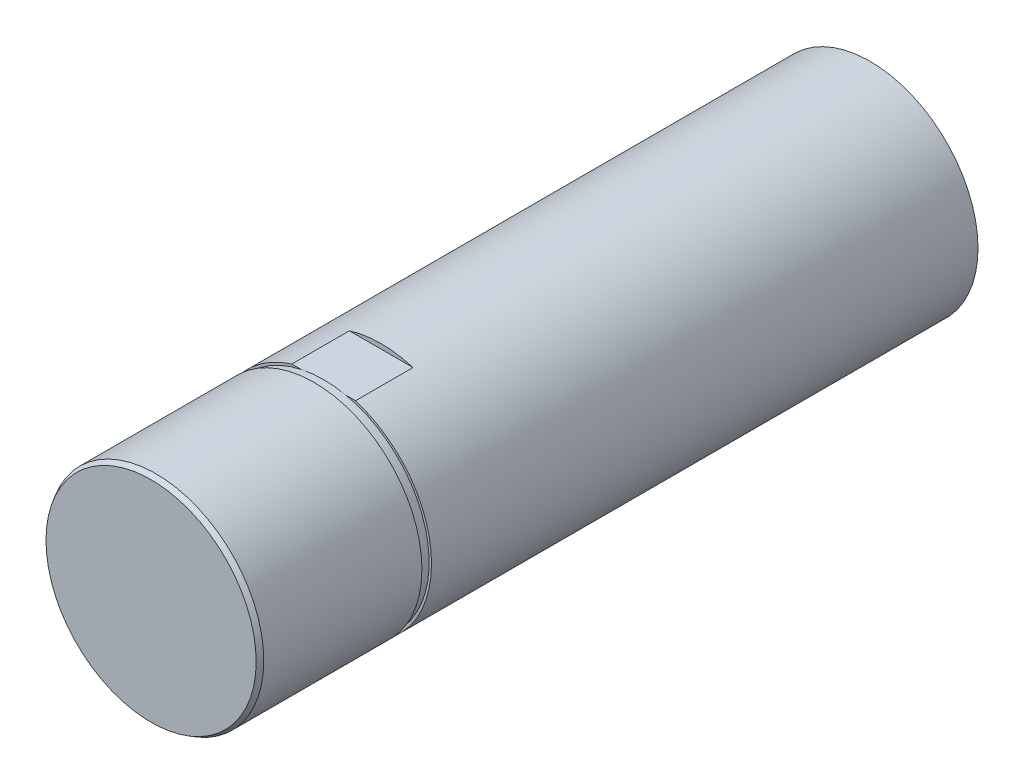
ISO-10303-21;
HEADER;
FILE_DESCRIPTION(('STEP AP214'),'2;1');
FILE_NAME('part.step','',(''),(''),'','','');
FILE_SCHEMA(('AUTOMOTIVE_DESIGN { 1 0 10303 214 1 1 1 1 }'));
ENDSEC;
DATA;
#1=APPLICATION_CONTEXT('core data for automotive mechanical design processes');
#2=APPLICATION_PROTOCOL_DEFINITION('international standard','automotive_design',2000,#1);
#3=PRODUCT_CONTEXT('',#1,'mechanical');
#4=PRODUCT('Part','Part','',(#3));
#5=PRODUCT_RELATED_PRODUCT_CATEGORY('part','',(#4));
#6=PRODUCT_DEFINITION_FORMATION('','',#4);
#7=PRODUCT_DEFINITION_CONTEXT('part definition',#1,'design');
#8=PRODUCT_DEFINITION('design','',#6,#7);
#9=PRODUCT_DEFINITION_SHAPE('','',#8);
#10=(LENGTH_UNIT() NAMED_UNIT(*) SI_UNIT(.MILLI.,.METRE.));
#11=(NAMED_UNIT(*) PLANE_ANGLE_UNIT() SI_UNIT($,.RADIAN.));
#12=(NAMED_UNIT(*) SI_UNIT($,.STERADIAN.) SOLID_ANGLE_UNIT());
#13=UNCERTAINTY_MEASURE_WITH_UNIT(LENGTH_MEASURE(1.E-05),#10,'distance_accuracy_value','');
#14=(GEOMETRIC_REPRESENTATION_CONTEXT(3) GLOBAL_UNCERTAINTY_ASSIGNED_CONTEXT((#13)) GLOBAL_UNIT_ASSIGNED_CONTEXT((#10,
#11,#12)) REPRESENTATION_CONTEXT('',''));
#15=CARTESIAN_POINT('',(0.,0.,0.));
#16=DIRECTION('',(0.,0.,1.));
#17=DIRECTION('',(1.,0.,0.));
#18=AXIS2_PLACEMENT_3D('',#15,#16,#17);
#19=CARTESIAN_POINT('',(0.,0.,14.));
#20=DIRECTION('',(0.,0.,1.));
#21=DIRECTION('',(1.,0.,0.));
#22=AXIS2_PLACEMENT_3D('',#19,#20,#21);
#23=PLANE('',#22);
#24=DIRECTION('',(1.,0.,0.));
#25=VECTOR('',#24,1.);
#26=CARTESIAN_POINT('',(-10.5,-21.5,14.));
#27=LINE('',#26,#25);
#28=CARTESIAN_POINT('',(4.6636895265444,-21.5,14.));
#29=VERTEX_POINT('',#28);
#30=CARTESIAN_POINT('',(6.63324958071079,-21.5,14.));
#31=VERTEX_POINT('',#30);
#32=EDGE_CURVE('E98',#29,#31,#27,.T.);
#33=ORIENTED_EDGE('',*,*,#32,.T.);
#34=CARTESIAN_POINT('',(0.,0.,14.));
#35=DIRECTION('',(0.,0.,1.));
#36=DIRECTION('',(1.,0.,0.));
#37=AXIS2_PLACEMENT_3D('',#34,#35,#36);
#38=CIRCLE('',#37,22.5);
#39=CARTESIAN_POINT('',(6.63324958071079,21.5,14.));
#40=VERTEX_POINT('',#39);
#41=EDGE_CURVE('E112',#31,#40,#38,.T.);
#42=ORIENTED_EDGE('',*,*,#41,.T.);
#43=DIRECTION('',(1.,0.,0.));
#44=VECTOR('',#43,1.);
#45=CARTESIAN_POINT('',(-10.5,21.5,14.));
#46=LINE('',#45,#44);
#47=CARTESIAN_POINT('',(4.6636895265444,21.5,14.));
#48=VERTEX_POINT('',#47);
#49=EDGE_CURVE('E146',#48,#40,#46,.T.);
#50=ORIENTED_EDGE('',*,*,#49,.F.);
#51=CARTESIAN_POINT('',(0.,0.,14.));
#52=DIRECTION('',(0.,0.,1.));
#53=DIRECTION('',(1.,0.,0.));
#54=AXIS2_PLACEMENT_3D('',#51,#52,#53);
#55=CIRCLE('',#54,22.);
#56=EDGE_CURVE('E140',#29,#48,#55,.T.);
#57=ORIENTED_EDGE('',*,*,#56,.F.);
#58=EDGE_LOOP('',(#33,#42,#50,#57));
#59=FACE_BOUND('',#58,.T.);
#60=ADVANCED_FACE('F35',(#59),#23,.T.);
#61=CARTESIAN_POINT('',(0.,0.,-100.));
#62=DIRECTION('',(0.,0.,1.));
#63=DIRECTION('',(1.,0.,0.));
#64=AXIS2_PLACEMENT_3D('',#61,#62,#63);
#65=CYLINDRICAL_SURFACE('',#64,22.5);
#66=CARTESIAN_POINT('',(0.,0.,16.));
#67=DIRECTION('',(0.,0.,1.));
#68=DIRECTION('',(1.,0.,0.));
#69=AXIS2_PLACEMENT_3D('',#66,#67,#68);
#70=CIRCLE('',#69,22.5);
#71=CARTESIAN_POINT('',(22.5,0.,16.));
#72=VERTEX_POINT('',#71);
#73=EDGE_CURVE('E111',#72,#72,#70,.T.);
#74=ORIENTED_EDGE('',*,*,#73,.T.);
#75=EDGE_LOOP('',(#74));
#76=FACE_BOUND('',#75,.T.);
#77=CARTESIAN_POINT('',(0.,0.,49.));
#78=DIRECTION('',(0.,0.,1.));
#79=DIRECTION('',(1.,0.,0.));
#80=AXIS2_PLACEMENT_3D('',#77,#78,#79);
#81=CIRCLE('',#80,22.5);
#82=CARTESIAN_POINT('',(22.5,0.,49.));
#83=VERTEX_POINT('',#82);
#84=EDGE_CURVE('E125',#83,#83,#81,.F.);
#85=ORIENTED_EDGE('',*,*,#84,.T.);
#86=EDGE_LOOP('',(#85));
#87=FACE_BOUND('',#86,.T.);
#88=ADVANCED_FACE('F176',(#76,#87),#65,.T.);
#89=CARTESIAN_POINT('',(0.,0.,50.));
#90=DIRECTION('',(0.,0.,1.));
#91=DIRECTION('',(1.,0.,0.));
#92=AXIS2_PLACEMENT_3D('',#89,#90,#91);
#93=PLANE('',#92);
#94=CARTESIAN_POINT('',(0.,0.,50.));
#95=DIRECTION('',(0.,0.,1.));
#96=DIRECTION('',(1.,0.,0.));
#97=AXIS2_PLACEMENT_3D('',#94,#95,#96);
#98=CIRCLE('',#97,21.9226497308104);
#99=CARTESIAN_POINT('',(21.9226497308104,0.,50.));
#100=VERTEX_POINT('',#99);
#101=EDGE_CURVE('E122',#100,#100,#98,.T.);
#102=ORIENTED_EDGE('',*,*,#101,.T.);
#103=EDGE_LOOP('',(#102));
#104=FACE_BOUND('',#103,.T.);
#105=ADVANCED_FACE('F181',(#104),#93,.T.);
#106=CARTESIAN_POINT('',(0.,0.,50.));
#107=DIRECTION('',(0.,0.,-1.));
#108=DIRECTION('',(-1.,0.,0.));
#109=AXIS2_PLACEMENT_3D('',#106,#107,#108);
#110=CONICAL_SURFACE('',#109,21.9226497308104,0.523598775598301);
#111=ORIENTED_EDGE('',*,*,#84,.F.);
#112=EDGE_LOOP('',(#111));
#113=FACE_BOUND('',#112,.T.);
#114=ORIENTED_EDGE('',*,*,#101,.F.);
#115=EDGE_LOOP('',(#114));
#116=FACE_BOUND('',#115,.T.);
#117=ADVANCED_FACE('F37',(#113,#116),#110,.T.);
#118=CARTESIAN_POINT('',(0.,0.,16.));
#119=DIRECTION('',(0.,0.,1.));
#120=DIRECTION('',(1.,0.,0.));
#121=AXIS2_PLACEMENT_3D('',#118,#119,#120);
#122=PLANE('',#121);
#123=ORIENTED_EDGE('',*,*,#73,.F.);
#124=EDGE_LOOP('',(#123));
#125=FACE_BOUND('',#124,.T.);
#126=CARTESIAN_POINT('',(0.,0.,16.));
#127=DIRECTION('',(0.,0.,1.));
#128=DIRECTION('',(1.,0.,0.));
#129=AXIS2_PLACEMENT_3D('',#126,#127,#128);
#130=CIRCLE('',#129,22.);
#131=CARTESIAN_POINT('',(22.,0.,16.));
#132=VERTEX_POINT('',#131);
#133=EDGE_CURVE('E117',#132,#132,#130,.T.);
#134=ORIENTED_EDGE('',*,*,#133,.T.);
#135=EDGE_LOOP('',(#134));
#136=FACE_BOUND('',#135,.T.);
#137=ADVANCED_FACE('F186',(#125,#136),#122,.F.);
#138=CARTESIAN_POINT('',(-6.63324958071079,-21.5,14.));
#139=VERTEX_POINT('',#138);
#140=CARTESIAN_POINT('',(-4.6636895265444,-21.5,14.));
#141=VERTEX_POINT('',#140);
#142=EDGE_CURVE('E87',#139,#141,#27,.T.);
#143=ORIENTED_EDGE('',*,*,#142,.T.);
#144=CARTESIAN_POINT('',(-4.6636895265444,21.5,14.));
#145=VERTEX_POINT('',#144);
#146=EDGE_CURVE('E150',#145,#141,#55,.T.);
#147=ORIENTED_EDGE('',*,*,#146,.F.);
#148=CARTESIAN_POINT('',(-6.63324958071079,21.5,14.));
#149=VERTEX_POINT('',#148);
#150=EDGE_CURVE('E110',#149,#145,#46,.T.);
#151=ORIENTED_EDGE('',*,*,#150,.F.);
#152=EDGE_CURVE('E104',#149,#139,#38,.T.);
#153=ORIENTED_EDGE('',*,*,#152,.T.);
#154=EDGE_LOOP('',(#143,#147,#151,#153));
#155=FACE_BOUND('',#154,.T.);
#156=ADVANCED_FACE('F108',(#155),#23,.T.);
#157=CARTESIAN_POINT('',(0.,0.,16.));
#158=DIRECTION('',(0.,0.,-1.));
#159=DIRECTION('',(-1.,0.,0.));
#160=AXIS2_PLACEMENT_3D('',#157,#158,#159);
#161=CYLINDRICAL_SURFACE('',#160,22.);
#162=ORIENTED_EDGE('',*,*,#133,.F.);
#163=EDGE_LOOP('',(#162));
#164=FACE_BOUND('',#163,.T.);
#165=EDGE_CURVE('E151',#48,#145,#55,.T.);
#166=ORIENTED_EDGE('',*,*,#165,.T.);
#167=ORIENTED_EDGE('',*,*,#146,.T.);
#168=CARTESIAN_POINT('',(0.,0.,14.));
#169=DIRECTION('',(0.,0.,1.));
#170=DIRECTION('',(1.,0.,0.));
#171=AXIS2_PLACEMENT_3D('',#168,#169,#170);
#172=CIRCLE('',#171,22.);
#173=EDGE_CURVE('E155',#141,#29,#172,.T.);
#174=ORIENTED_EDGE('',*,*,#173,.T.);
#175=ORIENTED_EDGE('',*,*,#56,.T.);
#176=EDGE_LOOP('',(#166,#167,#174,#175));
#177=FACE_BOUND('',#176,.T.);
#178=ADVANCED_FACE('F161',(#164,#177),#161,.T.);
#179=CARTESIAN_POINT('',(0.,0.,-100.));
#180=DIRECTION('',(0.,0.,1.));
#181=DIRECTION('',(1.,0.,0.));
#182=AXIS2_PLACEMENT_3D('',#179,#180,#181);
#183=PLANE('',#182);
#184=CARTESIAN_POINT('',(0.,0.,-100.));
#185=DIRECTION('',(0.,0.,1.));
#186=DIRECTION('',(1.,0.,0.));
#187=AXIS2_PLACEMENT_3D('',#184,#185,#186);
#188=CIRCLE('',#187,22.5);
#189=CARTESIAN_POINT('',(22.5,0.,-100.));
#190=VERTEX_POINT('',#189);
#191=EDGE_CURVE('E115',#190,#190,#188,.T.);
#192=ORIENTED_EDGE('',*,*,#191,.F.);
#193=EDGE_LOOP('',(#192));
#194=FACE_BOUND('',#193,.T.);
#195=ADVANCED_FACE('F191',(#194),#183,.F.);
#196=DIRECTION('',(0.,0.,1.));
#197=VECTOR('',#196,1.);
#198=CARTESIAN_POINT('',(-6.63324958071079,-21.5,-100.));
#199=LINE('',#198,#197);
#200=CARTESIAN_POINT('',(-6.63324958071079,-21.5,2.));
#201=VERTEX_POINT('',#200);
#202=EDGE_CURVE('E11',#139,#201,#199,.F.);
#203=ORIENTED_EDGE('',*,*,#202,.F.);
#204=ORIENTED_EDGE('',*,*,#152,.F.);
#205=DIRECTION('',(0.,0.,1.));
#206=VECTOR('',#205,1.);
#207=CARTESIAN_POINT('',(-6.63324958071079,21.5,-100.));
#208=LINE('',#207,#206);
#209=CARTESIAN_POINT('',(-6.63324958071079,21.5,2.));
#210=VERTEX_POINT('',#209);
#211=EDGE_CURVE('E128',#210,#149,#208,.T.);
#212=ORIENTED_EDGE('',*,*,#211,.F.);
#213=CARTESIAN_POINT('',(0.,0.,2.));
#214=DIRECTION('',(0.,0.,-1.));
#215=DIRECTION('',(-1.,0.,0.));
#216=AXIS2_PLACEMENT_3D('',#213,#214,#215);
#217=CIRCLE('',#216,22.5);
#218=CARTESIAN_POINT('',(6.63324958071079,21.5,2.));
#219=VERTEX_POINT('',#218);
#220=EDGE_CURVE('E130',#219,#210,#217,.F.);
#221=ORIENTED_EDGE('',*,*,#220,.F.);
#222=DIRECTION('',(0.,0.,1.));
#223=VECTOR('',#222,1.);
#224=CARTESIAN_POINT('',(6.63324958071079,21.5,-100.));
#225=LINE('',#224,#223);
#226=EDGE_CURVE('E132',#40,#219,#225,.F.);
#227=ORIENTED_EDGE('',*,*,#226,.F.);
#228=ORIENTED_EDGE('',*,*,#41,.F.);
#229=DIRECTION('',(0.,0.,1.));
#230=VECTOR('',#229,1.);
#231=CARTESIAN_POINT('',(6.63324958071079,-21.5,-100.));
#232=LINE('',#231,#230);
#233=CARTESIAN_POINT('',(6.63324958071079,-21.5,2.));
#234=VERTEX_POINT('',#233);
#235=EDGE_CURVE('E43',#234,#31,#232,.T.);
#236=ORIENTED_EDGE('',*,*,#235,.F.);
#237=CARTESIAN_POINT('',(0.,0.,2.));
#238=DIRECTION('',(0.,0.,-1.));
#239=DIRECTION('',(-1.,0.,0.));
#240=AXIS2_PLACEMENT_3D('',#237,#238,#239);
#241=CIRCLE('',#240,22.5);
#242=EDGE_CURVE('E106',#201,#234,#241,.F.);
#243=ORIENTED_EDGE('',*,*,#242,.F.);
#244=EDGE_LOOP('',(#203,#204,#212,#221,#227,#228,#236,#243));
#245=FACE_BOUND('',#244,.T.);
#246=ORIENTED_EDGE('',*,*,#191,.T.);
#247=EDGE_LOOP('',(#246));
#248=FACE_BOUND('',#247,.T.);
#249=ADVANCED_FACE('F101',(#245,#248),#65,.T.);
#250=CARTESIAN_POINT('',(-10.5,23.,14.));
#251=DIRECTION('',(0.,0.,1.));
#252=DIRECTION('',(1.,0.,0.));
#253=AXIS2_PLACEMENT_3D('',#250,#251,#252);
#254=PLANE('',#253);
#255=EDGE_CURVE('E152',#145,#48,#46,.T.);
#256=ORIENTED_EDGE('',*,*,#255,.F.);
#257=ORIENTED_EDGE('',*,*,#165,.F.);
#258=EDGE_LOOP('',(#256,#257));
#259=FACE_BOUND('',#258,.T.);
#260=ADVANCED_FACE('F202',(#259),#254,.F.);
#261=CARTESIAN_POINT('',(-10.5,23.,2.));
#262=DIRECTION('',(0.,0.,-1.));
#263=DIRECTION('',(-1.,0.,0.));
#264=AXIS2_PLACEMENT_3D('',#261,#262,#263);
#265=PLANE('',#264);
#266=ORIENTED_EDGE('',*,*,#220,.T.);
#267=DIRECTION('',(1.,0.,0.));
#268=VECTOR('',#267,1.);
#269=CARTESIAN_POINT('',(-10.5,21.5,2.));
#270=LINE('',#269,#268);
#271=EDGE_CURVE('E56',#210,#219,#270,.T.);
#272=ORIENTED_EDGE('',*,*,#271,.T.);
#273=EDGE_LOOP('',(#266,#272));
#274=FACE_BOUND('',#273,.T.);
#275=ADVANCED_FACE('F148',(#274),#265,.F.);
#276=CARTESIAN_POINT('',(-10.5,21.5,14.));
#277=DIRECTION('',(0.,-1.,0.));
#278=DIRECTION('',(0.,0.,-1.));
#279=AXIS2_PLACEMENT_3D('',#276,#277,#278);
#280=PLANE('',#279);
#281=ORIENTED_EDGE('',*,*,#226,.T.);
#282=ORIENTED_EDGE('',*,*,#271,.F.);
#283=ORIENTED_EDGE('',*,*,#211,.T.);
#284=ORIENTED_EDGE('',*,*,#150,.T.);
#285=ORIENTED_EDGE('',*,*,#255,.T.);
#286=ORIENTED_EDGE('',*,*,#49,.T.);
#287=EDGE_LOOP('',(#281,#282,#283,#284,#285,#286));
#288=FACE_BOUND('',#287,.T.);
#289=ADVANCED_FACE('F144',(#288),#280,.F.);
#290=CARTESIAN_POINT('',(-10.5,-21.5,14.));
#291=DIRECTION('',(0.,0.,1.));
#292=DIRECTION('',(1.,0.,0.));
#293=AXIS2_PLACEMENT_3D('',#290,#291,#292);
#294=PLANE('',#293);
#295=EDGE_CURVE('E92',#141,#29,#27,.T.);
#296=ORIENTED_EDGE('',*,*,#295,.T.);
#297=ORIENTED_EDGE('',*,*,#173,.F.);
#298=EDGE_LOOP('',(#296,#297));
#299=FACE_BOUND('',#298,.T.);
#300=ADVANCED_FACE('F164',(#299),#294,.F.);
#301=CARTESIAN_POINT('',(-10.5,-21.5,14.));
#302=DIRECTION('',(0.,1.,0.));
#303=DIRECTION('',(0.,0.,1.));
#304=AXIS2_PLACEMENT_3D('',#301,#302,#303);
#305=PLANE('',#304);
#306=ORIENTED_EDGE('',*,*,#202,.T.);
#307=DIRECTION('',(1.,0.,0.));
#308=VECTOR('',#307,1.);
#309=CARTESIAN_POINT('',(-10.5,-21.5,2.));
#310=LINE('',#309,#308);
#311=EDGE_CURVE('E49',#201,#234,#310,.T.);
#312=ORIENTED_EDGE('',*,*,#311,.T.);
#313=ORIENTED_EDGE('',*,*,#235,.T.);
#314=ORIENTED_EDGE('',*,*,#32,.F.);
#315=ORIENTED_EDGE('',*,*,#295,.F.);
#316=ORIENTED_EDGE('',*,*,#142,.F.);
#317=EDGE_LOOP('',(#306,#312,#313,#314,#315,#316));
#318=FACE_BOUND('',#317,.T.);
#319=ADVANCED_FACE('F89',(#318),#305,.F.);
#320=CARTESIAN_POINT('',(-10.5,-21.5,2.));
#321=DIRECTION('',(0.,0.,-1.));
#322=DIRECTION('',(-1.,0.,0.));
#323=AXIS2_PLACEMENT_3D('',#320,#321,#322);
#324=PLANE('',#323);
#325=ORIENTED_EDGE('',*,*,#242,.T.);
#326=ORIENTED_EDGE('',*,*,#311,.F.);
#327=EDGE_LOOP('',(#325,#326));
#328=FACE_BOUND('',#327,.T.);
#329=ADVANCED_FACE('F171',(#328),#324,.F.);
#330=CLOSED_SHELL('',(#60,#88,#105,#117,#137,#156,#178,#195,#249,#260,#275,#289,#300,#319,#329));
#331=MANIFOLD_SOLID_BREP('B2',#330);
#332=ADVANCED_BREP_SHAPE_REPRESENTATION('',(#18,#331),#14);
#333=SHAPE_DEFINITION_REPRESENTATION(#9,#332);
ENDSEC;
END-ISO-10303-21;
